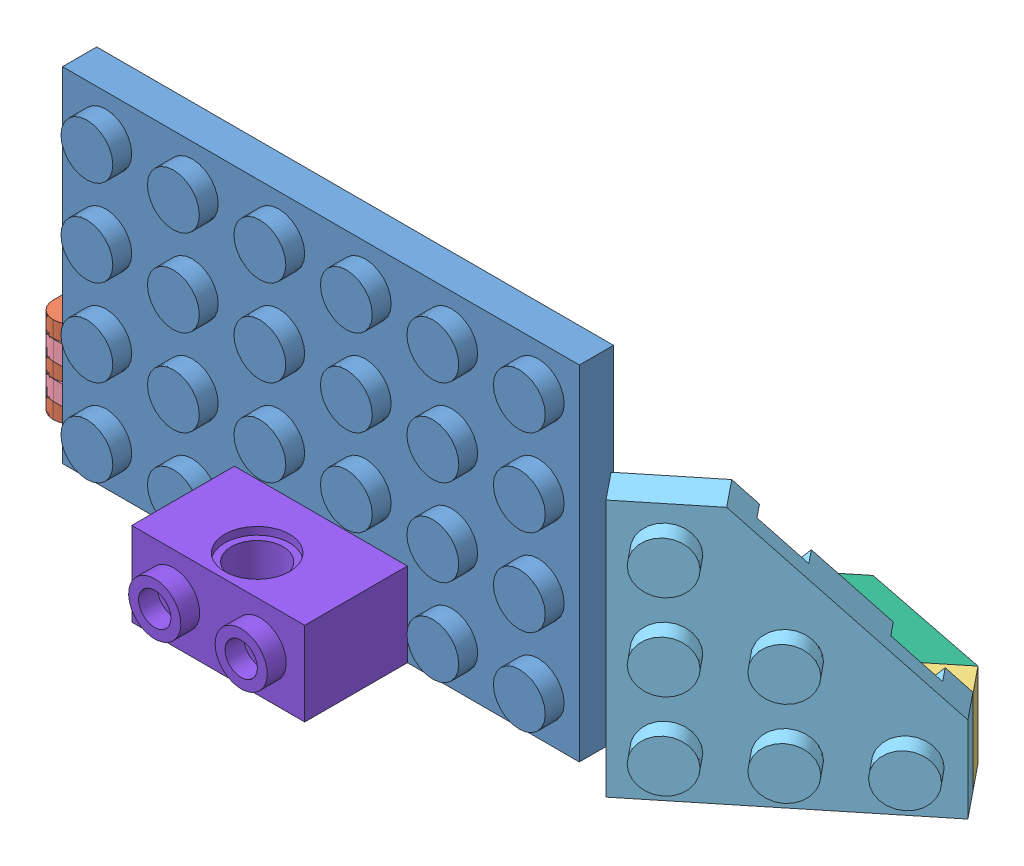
SolidWorks assembly Fender Links.SLDASM, configuration Default (file format 4400). Lengths in mm.
Overall size (80.62 36.88 37.08).
10 component instances, 9 part files, 25 mates.
Components (placement in the parent):
- Part0L64Rood-1: Part0L64Rood.SLDPRT [기본 설정] at origin size (47.8 31.8 4.91)
- Part0L2Rood scharnier-1: Part0L2Rood scharnier.SLDPRT [Default] at (-11.0476 -27.9317 -16.596) x (0 0 1) z (0 -1 0) size (13.4 4.87 15.8)
- Part0L2RoodB-1: Part0L2RoodB.SLDPRT [Default] at (45.3722 -16.2617 -8.5038) x (0 -1 0) z (-0.777146 0 0.62932) size (7.8 4.87 21.4)
- Part0L6BlauwB-1: Part0L6BlauwB.SLDPRT [Default] at (39.2224 -16.1317 -6.326) x (-1 0 0) z (0 1 0) size (59 4.87 7.8)
- 3x3 corner-1: 3x3 corner.sldprt [Default] at (50.3955 -12.1617 -8.4977) x (0.777146 0 -0.62932) z (0 -1 0) size (23.8 4.87 23.8)
- Op zijn KOP 2HRood-1: Op zijn KOP 2HRood.SLDPRT [Default] at (45.5331 -20.1617 -20.8583) x (0.777146 0 -0.62932) z (0 -1 0) size (15.8 11.2 7.8)
- BASIS TECHNIEK 6 HRood-1: BASIS TECHNIEK 6 HRood.SLDPRT [Default] at (-8.5776 -20.0067 -11.076) x (0 1 0) z (1 0 0) size (7.75 11.25 48)
- BASIS TECHNIEK 2 HRood-1: BASIS TECHNIEK 2 HRood.SLDPRT [Default] at (7.3224 -20.0567 4.75) x (0 1 0) z (1 0 0) size (7.75 11.25 16)
- Remlicht Rood-1: Remlicht Rood.SLDPRT [Default] at (-14.2136 -23.9317 -12.596) x (0 0.375857 -0.926678) z (0 0.926678 0.375857) size (7.8 3.7 7.8)
- Remlicht Rood-2: Remlicht Rood.SLDPRT [Default] at (-14.2136 -15.9317 -12.596) x (0 -0.836551 -0.54789) z (0 0.54789 -0.836551) size (7.8 3.7 7.8)
Mates (geometry in assembly coordinates):
- Coincident5: coincident aligned: plane of Part0L64Rood-1 through (-8.5776 7.8683 -3.16) normal (-1 0 0); plane of Part0L6BlauwB-1 through (-8.5776 -16.1317 -3.16) normal (-1 0 0)
- Concentric1: concentric anti-aligned: cylinder of Part0L2Rood scharnier-1 through (-12.5976 -12.1317 -4.746) axis (0 -1 0) radius 0.25; cylinder of Part0L6BlauwB-1 through (-12.5976 -23.9317 -4.746) axis (0 1 0) radius 0.25
- Coincident7: coincident anti-aligned: plane of Part0L2Rood scharnier-1 through (-11.0476 -20.7317 -3.196) normal (0 -1 0); plane of Part0L6BlauwB-1 through (-10.1776 -20.7317 -3.16) normal (0 1 0)
- Concentric2: concentric anti-aligned: cylinder of Part0L2RoodB-1 through (43.2424 -24.0617 -4.746) axis (0 1 0) radius 0.25; cylinder of Part0L6BlauwB-1 through (43.2424 -16.1317 -4.746) axis (0 -1 0) radius 0.25
- Coincident8: coincident anti-aligned: plane of Part0L2RoodB-1 through (46.1212 -19.4317 -5.0364) normal (0 -1 0); plane of Part0L6BlauwB-1 through (44.8224 -19.4317 -6.326) normal (0 1 0)
- Coincident11: coincident anti-aligned: plane of Part0L2RoodB-1 through (59.6435 -16.2617 -15.9866) normal (0.62932 0 0.777146); plane of 3x3 corner-1 through (41.1475 -24.0617 -1.0088) normal (-0.62932 0 -0.777146)
- Coincident12: coincident aligned: plane of Part0L2RoodB-1 through (47.3646 -16.2617 -6.0433) normal (0 1 0); plane of Op zijn KOP 2HRood-1 through (57.6511 -16.2617 -18.447) normal (0 1 0)
- Coincident13: coincident anti-aligned: plane of Part0L2RoodB-1 through (57.6511 -16.2617 -18.447) normal (-0.62932 0 -0.777146); plane of Op zijn KOP 2HRood-1 through (45.3722 -16.2617 -8.5038) normal (0.62932 0 0.777146)
- Coincident14: coincident aligned: plane of Part0L2RoodB-1 through (47.3646 -16.2617 -6.0433) normal (-0.777146 0 0.62932); plane of Op zijn KOP 2HRood-1 through (45.3722 -24.0617 -8.5038) normal (-0.777146 0 0.62932)
- Coincident15: coincident aligned: plane of Part0L6BlauwB-1 through (39.2224 -16.1317 -3.16) normal (0 1 0); plane of BASIS TECHNIEK 6 HRood-1 through (39.4224 -16.1317 -15.826) normal (0 1 0)
- Coincident16: coincident aligned: plane of Part0L6BlauwB-1 through (-8.5776 -16.1317 -3.16) normal (-1 0 0); plane of BASIS TECHNIEK 6 HRood-1 through (-8.5776 -23.8817 -6.326) normal (-1 0 0)
- Width1: width: plane of Part0L64Rood-1 through (39.2224 7.8683 -3.16) normal (1 0 0); plane of Part0L64Rood-1 through (-8.5776 7.8683 -3.16) normal (-1 0 0); plane of BASIS TECHNIEK 2 HRood-1 through (7.3224 -23.9317 9.5) normal (-1 0 0); plane of BASIS TECHNIEK 2 HRood-1 through (23.3224 -23.9317 9.5) normal (1 0 0)
- Parallel1: parallel anti-aligned: plane of Part0L2Rood scharnier-1 through (-11.0476 -12.1317 -16.596) normal (1 0 0); plane of BASIS TECHNIEK 6 HRood-1 through (-8.5776 -23.8817 -6.326) normal (-1 0 0)
- Concentric3: concentric aligned: cylinder of Part0L2Rood scharnier-1 through (-15.9136 -15.9317 -12.596) axis (1 0 0) radius 2.4; cylinder of Remlicht Rood-2 through (-15.9136 -15.9317 -12.596) axis (1 0 0) radius 2.4
- Concentric4: concentric aligned: cylinder of Part0L2Rood scharnier-1 through (-15.9136 -23.9317 -12.596) axis (1 0 0) radius 2.4; cylinder of Remlicht Rood-1 through (-15.9136 -23.9317 -12.596) axis (1 0 0) radius 2.4
- Coincident21: coincident anti-aligned: plane of Part0L2Rood scharnier-1 through (-14.2136 -12.1317 -16.596) normal (-1 0 0); plane of Remlicht Rood-2 through (-14.2136 -15.9317 -12.596) normal (1 0 0)
- Coincident22: coincident anti-aligned: plane of Part0L2Rood scharnier-1 through (-14.2136 -12.1317 -16.596) normal (-1 0 0); plane of Remlicht Rood-1 through (-14.2136 -23.9317 -12.596) normal (1 0 0)
- Coincident23: coincident aligned: plane of Part0L64Rood-1 through (-8.5776 -23.9317 -3.16) normal (0 -1 0); plane of Part0L6BlauwB-1 through (39.2224 -23.9317 -3.16) normal (0 -1 0)
- Coincident24: coincident anti-aligned: plane of Part0L64Rood-1 through (-8.5776 -23.9317 -3.16) normal (0 0 -1); plane of Part0L6BlauwB-1 through (39.2224 -23.9317 -3.16) normal (0 0 1)
- Coincident25: coincident anti-aligned: plane of Part0L6BlauwB-1 through (39.2224 -23.9317 -6.326) normal (0 0 -1); plane of BASIS TECHNIEK 6 HRood-1 through (39.4224 -16.1317 -6.326) normal (0 0 1)
- Coincident26: coincident aligned: plane of Part0L64Rood-1 through (-8.5776 -23.9317 -3.16) normal (0 -1 0); plane of BASIS TECHNIEK 2 HRood-1 through (23.3224 -23.9317 0) normal (0 -1 0)
- Coincident27: coincident anti-aligned: plane of Part0L64Rood-1 through (-8.5776 -23.9317 0) normal (0 0 1); plane of BASIS TECHNIEK 2 HRood-1 through (23.3224 -16.1817 0) normal (0 0 -1)
- Coincident28: coincident aligned: plane of Part0L2RoodB-1 through (59.6435 -16.2617 -15.9866) normal (0.777146 0 -0.62932); plane of 3x3 corner-1 through (61.636 -24.0617 -13.5261) normal (0.777146 0 -0.62932)
- Coincident29: coincident aligned: plane of Part0L2RoodB-1 through (47.3646 -24.0617 -6.0433) normal (0 -1 0); plane of 3x3 corner-1 through (61.636 -24.0617 -13.5261) normal (0 -1 0)
- Angle1: planar angle = 0.680678 rad aligned: plane of 3x3 corner-1 through (41.1475 -24.0617 -1.0088) normal (-0.62932 0 -0.777146); plane of Part0L64Rood-1 through (-8.5776 -23.9317 -3.16) normal (0 0 -1)
